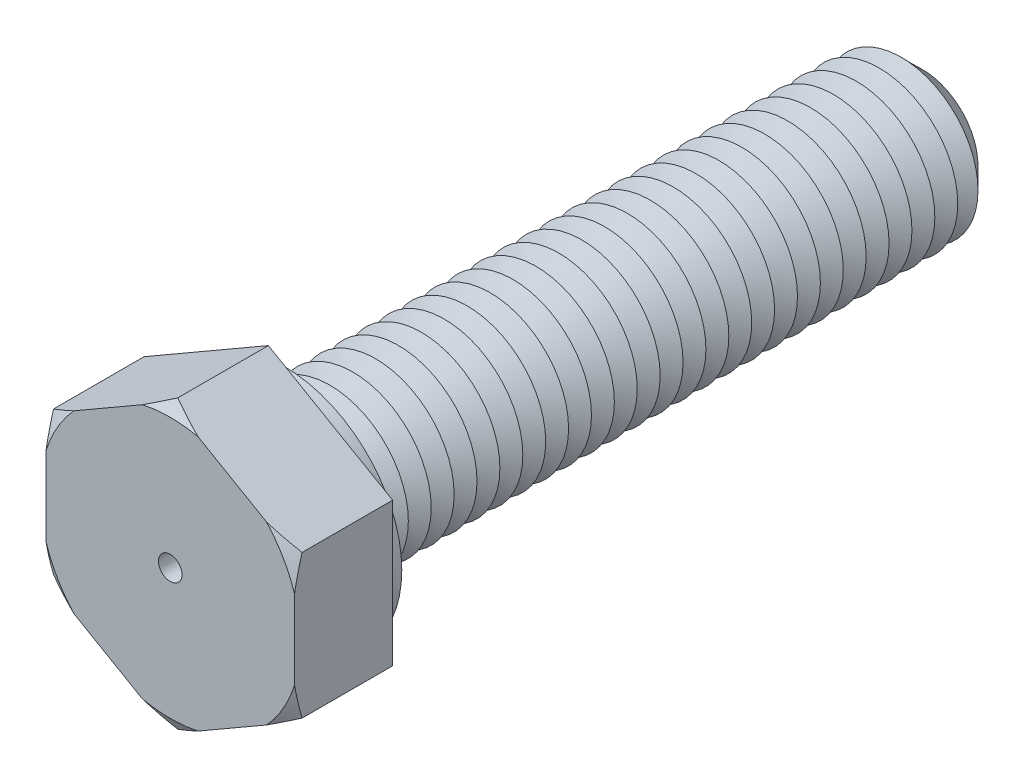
from build123d import *

# Parameters (mm, degrees)
BOSS_EXTRUDE1_DEPTH = 7.5
SKETCH3_R           = 6
BOSS_EXTRUDE2_DEPTH = 50
SKETCH4_R           = 9
BOSS_EXTRUDE3_DEPTH = 1.2
CHAMFER1_SIZE       = 1.75
LPATTERN1_COUNT     = 27
LPATTERN1_PITCH     = 1.75
SKETCH8_R           = 0.9
CUT_EXTRUDE1_DEPTH  = 57.5


with BuildPart() as part:
    # Sketch2 → Boss-Extrude1 (new body)
    with BuildSketch(Plane.XY):
        Polygon((0, 10.969655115), (-9.5, 5.484827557), (-9.5, -5.484827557), (0, -10.969655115), (9.5, -5.484827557), (9.5, 5.484827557), align=None)
    extrude(amount=BOSS_EXTRUDE1_DEPTH)

    # Sketch3 → Boss-Extrude2 (add)
    with BuildSketch(Plane(origin=(0, 0, 0), x_dir=(-1, 0, 0), z_dir=(0, 0, -1))):
        Circle(SKETCH3_R)
    extrude(amount=BOSS_EXTRUDE2_DEPTH)

    # Sketch4 → Boss-Extrude3 (add)
    with BuildSketch(Plane(origin=(0, 0, 0), x_dir=(-1, 0, 0), z_dir=(0, 0, -1))):
        with Locations(Location((0, 0, 0), (0, 0, 180))):
            Circle(SKETCH4_R)
    extrude(amount=BOSS_EXTRUDE3_DEPTH)

    # Chamfer1
    chamfer1_edges = [part.edges().sort_by_distance(p)[0] for p in [
        (6, 0, -50),
    ]]
    chamfer(chamfer1_edges, length=CHAMFER1_SIZE)

    # Sketch6 → Cut-Revolve1 (revolve, cut)
    with BuildSketch(Plane(origin=(0, 0, 0), x_dir=(0, 0, -1), z_dir=(1, 0, 0)), mode=Mode.PRIVATE) as cut_revolve1_sk:
        Polygon((1.2, 6), (2.075, 4.484455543), (2.95, 6), align=None)
    cut_revolve1 = revolve(cut_revolve1_sk.sketch.rotate(Axis((0, 0, 3.211670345), (0, 0, -1)), 90), axis=Axis((0, 0, 3.211670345), (0, 0, -1)), mode=Mode.SUBTRACT)

    # LPattern1: Cut-Revolve1 ×27
    with Locations(*[(0, 0, -i * LPATTERN1_PITCH) for i in range(1, LPATTERN1_COUNT)]):
        add(cut_revolve1, mode=Mode.SUBTRACT)

    # Sketch7 → Cut-Revolve2 (revolve, cut)
    with BuildSketch(Plane(origin=(0, 0, 0), x_dir=(0, 0, -1), z_dir=(1, 0, 0)), mode=Mode.PRIVATE) as cut_revolve2_sk:
        Polygon((-7.5, 10.969655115), (-7.5, 9.969655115), (-6.922649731, 10.969655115), align=None)
    revolve(cut_revolve2_sk.sketch.rotate(Axis((0, 0, 3.211670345), (0, 0, -1)), 90), axis=Axis((0, 0, 3.211670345), (0, 0, -1)), mode=Mode.SUBTRACT)

    # Sketch8 → Cut-Extrude1 (cut)
    with BuildSketch(Plane.XY.offset(7.5)):
        Circle(SKETCH8_R)
    extrude(amount=-CUT_EXTRUDE1_DEPTH, mode=Mode.SUBTRACT)


solid = part.part
